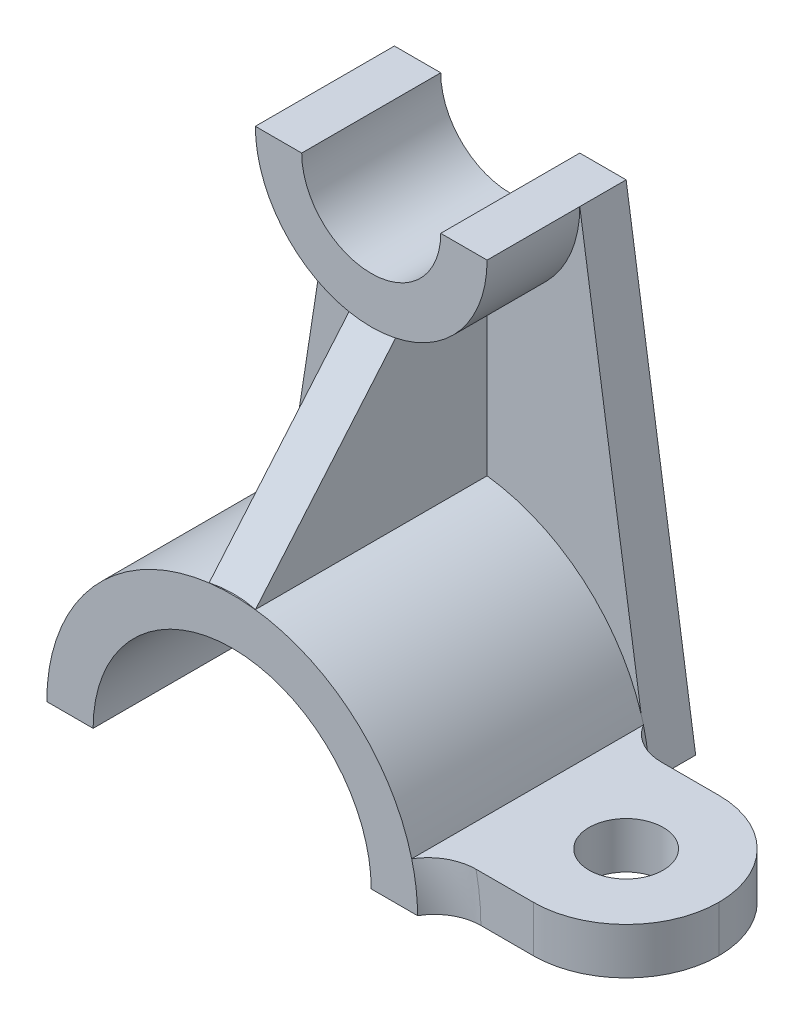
ISO-10303-21;
HEADER;
FILE_DESCRIPTION(('STEP AP214'),'2;1');
FILE_NAME('part.step','',(''),(''),'','','');
FILE_SCHEMA(('AUTOMOTIVE_DESIGN { 1 0 10303 214 1 1 1 1 }'));
ENDSEC;
DATA;
#1=APPLICATION_CONTEXT('core data for automotive mechanical design processes');
#2=APPLICATION_PROTOCOL_DEFINITION('international standard','automotive_design',2000,#1);
#3=PRODUCT_CONTEXT('',#1,'mechanical');
#4=PRODUCT('Part','Part','',(#3));
#5=PRODUCT_RELATED_PRODUCT_CATEGORY('part','',(#4));
#6=PRODUCT_DEFINITION_FORMATION('','',#4);
#7=PRODUCT_DEFINITION_CONTEXT('part definition',#1,'design');
#8=PRODUCT_DEFINITION('design','',#6,#7);
#9=PRODUCT_DEFINITION_SHAPE('','',#8);
#10=(LENGTH_UNIT() NAMED_UNIT(*) SI_UNIT(.MILLI.,.METRE.));
#11=(NAMED_UNIT(*) PLANE_ANGLE_UNIT() SI_UNIT($,.RADIAN.));
#12=(NAMED_UNIT(*) SI_UNIT($,.STERADIAN.) SOLID_ANGLE_UNIT());
#13=UNCERTAINTY_MEASURE_WITH_UNIT(LENGTH_MEASURE(1.E-05),#10,'distance_accuracy_value','');
#14=(GEOMETRIC_REPRESENTATION_CONTEXT(3) GLOBAL_UNCERTAINTY_ASSIGNED_CONTEXT((#13)) GLOBAL_UNIT_ASSIGNED_CONTEXT((#10,
#11,#12)) REPRESENTATION_CONTEXT('',''));
#15=CARTESIAN_POINT('',(0.,0.,0.));
#16=DIRECTION('',(0.,0.,1.));
#17=DIRECTION('',(1.,0.,0.));
#18=AXIS2_PLACEMENT_3D('',#15,#16,#17);
#19=CARTESIAN_POINT('',(0.,100.,0.));
#20=DIRECTION('',(0.,0.,-1.));
#21=DIRECTION('',(-1.,0.,0.));
#22=AXIS2_PLACEMENT_3D('',#19,#20,#21);
#23=PLANE('',#22);
#24=DIRECTION('',(0.,-1.,0.));
#25=VECTOR('',#24,1.);
#26=CARTESIAN_POINT('',(-5.,100.,0.));
#27=LINE('',#26,#25);
#28=CARTESIAN_POINT('',(-5.,75.5051025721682,0.));
#29=VERTEX_POINT('',#28);
#30=CARTESIAN_POINT('',(-5.,39.6862696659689,0.));
#31=VERTEX_POINT('',#30);
#32=EDGE_CURVE('E196',#29,#31,#27,.T.);
#33=ORIENTED_EDGE('',*,*,#32,.F.);
#34=CARTESIAN_POINT('',(0.,100.,0.));
#35=DIRECTION('',(0.,0.,-1.));
#36=DIRECTION('',(-1.,0.,0.));
#37=AXIS2_PLACEMENT_3D('',#34,#35,#36);
#38=CIRCLE('',#37,25.);
#39=CARTESIAN_POINT('',(-25.,100.,0.));
#40=VERTEX_POINT('',#39);
#41=EDGE_CURVE('E255',#29,#40,#38,.T.);
#42=ORIENTED_EDGE('',*,*,#41,.T.);
#43=DIRECTION('',(-0.152941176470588,-0.988235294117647,0.));
#44=VECTOR('',#43,1.);
#45=CARTESIAN_POINT('',(-40.465219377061,0.0708901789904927,0.));
#46=LINE('',#45,#44);
#47=CARTESIAN_POINT('',(-39.5294117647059,6.11764705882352,0.));
#48=VERTEX_POINT('',#47);
#49=EDGE_CURVE('E267',#40,#48,#46,.T.);
#50=ORIENTED_EDGE('',*,*,#49,.T.);
#51=CARTESIAN_POINT('',(0.,0.,0.));
#52=DIRECTION('',(0.,0.,-1.));
#53=DIRECTION('',(-1.,0.,0.));
#54=AXIS2_PLACEMENT_3D('',#51,#52,#53);
#55=CIRCLE('',#54,40.);
#56=EDGE_CURVE('E299',#48,#31,#55,.T.);
#57=ORIENTED_EDGE('',*,*,#56,.T.);
#58=EDGE_LOOP('',(#33,#42,#50,#57));
#59=FACE_BOUND('',#58,.T.);
#60=ADVANCED_FACE('F32',(#59),#23,.F.);
#61=CARTESIAN_POINT('',(0.,100.,20.));
#62=DIRECTION('',(0.,0.,-1.));
#63=DIRECTION('',(-1.,0.,0.));
#64=AXIS2_PLACEMENT_3D('',#61,#62,#63);
#65=CYLINDRICAL_SURFACE('',#64,25.);
#66=DIRECTION('',(0.,0.,-1.));
#67=VECTOR('',#66,1.);
#68=CARTESIAN_POINT('',(5.,75.5051025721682,20.));
#69=LINE('',#68,#67);
#70=CARTESIAN_POINT('',(5.,75.5051025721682,0.));
#71=VERTEX_POINT('',#70);
#72=CARTESIAN_POINT('',(5.,75.5051025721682,19.5713843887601));
#73=VERTEX_POINT('',#72);
#74=EDGE_CURVE('E201',#71,#73,#69,.F.);
#75=ORIENTED_EDGE('',*,*,#74,.F.);
#76=CARTESIAN_POINT('',(25.,100.,0.));
#77=VERTEX_POINT('',#76);
#78=EDGE_CURVE('E263',#77,#71,#38,.T.);
#79=ORIENTED_EDGE('',*,*,#78,.F.);
#80=DIRECTION('',(0.,0.,-1.));
#81=VECTOR('',#80,1.);
#82=CARTESIAN_POINT('',(25.,100.,20.));
#83=LINE('',#82,#81);
#84=CARTESIAN_POINT('',(25.,100.,20.));
#85=VERTEX_POINT('',#84);
#86=EDGE_CURVE('E252',#85,#77,#83,.T.);
#87=ORIENTED_EDGE('',*,*,#86,.F.);
#88=CARTESIAN_POINT('',(0.,100.,20.));
#89=DIRECTION('',(0.,0.,-1.));
#90=DIRECTION('',(-1.,0.,0.));
#91=AXIS2_PLACEMENT_3D('',#88,#89,#90);
#92=CIRCLE('',#91,25.);
#93=CARTESIAN_POINT('',(0.,75.,20.));
#94=VERTEX_POINT('',#93);
#95=EDGE_CURVE('E239',#85,#94,#92,.T.);
#96=ORIENTED_EDGE('',*,*,#95,.T.);
#97=CARTESIAN_POINT('',(0.,100.,-1.21428571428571));
#98=DIRECTION('',(0.,0.647015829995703,0.762476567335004));
#99=DIRECTION('',(0.,0.762476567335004,-0.647015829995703));
#100=AXIS2_PLACEMENT_3D('',#97,#98,#99);
#101=ELLIPSE('',#100,32.7878928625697,25.);
#102=EDGE_CURVE('E218',#73,#94,#101,.F.);
#103=ORIENTED_EDGE('',*,*,#102,.F.);
#104=EDGE_LOOP('',(#75,#79,#87,#96,#103));
#105=FACE_BOUND('',#104,.T.);
#106=ADVANCED_FACE('F417',(#105),#65,.T.);
#107=CARTESIAN_POINT('',(0.,0.,0.));
#108=DIRECTION('',(0.,0.,1.));
#109=DIRECTION('',(1.,0.,0.));
#110=AXIS2_PLACEMENT_3D('',#107,#108,#109);
#111=PLANE('',#110);
#112=CARTESIAN_POINT('',(0.,0.,0.));
#113=DIRECTION('',(0.,0.,1.));
#114=DIRECTION('',(1.,0.,0.));
#115=AXIS2_PLACEMENT_3D('',#112,#113,#114);
#116=CIRCLE('',#115,40.);
#117=CARTESIAN_POINT('',(-39.9999379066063,0.0704802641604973,0.));
#118=VERTEX_POINT('',#117);
#119=CARTESIAN_POINT('',(-40.,-2.61554938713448E-13,0.));
#120=VERTEX_POINT('',#119);
#121=EDGE_CURVE('E331',#118,#120,#116,.T.);
#122=ORIENTED_EDGE('',*,*,#121,.F.);
#123=DIRECTION('',(0.999999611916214,-0.000881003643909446,0.));
#124=VECTOR('',#123,1.);
#125=CARTESIAN_POINT('',(-40.465219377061,0.0708901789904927,0.));
#126=LINE('',#125,#124);
#127=CARTESIAN_POINT('',(-29.9999366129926,0.0616702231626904,0.));
#128=VERTEX_POINT('',#127);
#129=EDGE_CURVE('E275',#118,#128,#126,.T.);
#130=ORIENTED_EDGE('',*,*,#129,.T.);
#131=CARTESIAN_POINT('',(0.,0.,0.));
#132=DIRECTION('',(0.,0.,-1.));
#133=DIRECTION('',(1.,0.,0.));
#134=AXIS2_PLACEMENT_3D('',#131,#132,#133);
#135=CIRCLE('',#134,30.);
#136=CARTESIAN_POINT('',(-30.,-2.09489001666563E-13,0.));
#137=VERTEX_POINT('',#136);
#138=EDGE_CURVE('E326',#137,#128,#135,.T.);
#139=ORIENTED_EDGE('',*,*,#138,.F.);
#140=DIRECTION('',(1.,0.,0.));
#141=VECTOR('',#140,1.);
#142=CARTESIAN_POINT('',(-40.,-2.79318668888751E-13,0.));
#143=LINE('',#142,#141);
#144=EDGE_CURVE('E335',#120,#137,#143,.T.);
#145=ORIENTED_EDGE('',*,*,#144,.F.);
#146=EDGE_LOOP('',(#122,#130,#139,#145));
#147=FACE_BOUND('',#146,.T.);
#148=ADVANCED_FACE('F425',(#147),#111,.F.);
#149=CARTESIAN_POINT('',(40.,0.,0.));
#150=VERTEX_POINT('',#149);
#151=CARTESIAN_POINT('',(38.7298334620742,10.,0.));
#152=VERTEX_POINT('',#151);
#153=EDGE_CURVE('E332',#150,#152,#116,.T.);
#154=ORIENTED_EDGE('',*,*,#153,.F.);
#155=DIRECTION('',(-0.148340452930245,0.988936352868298,0.));
#156=VECTOR('',#155,1.);
#157=CARTESIAN_POINT('',(40.,0.,0.));
#158=LINE('',#157,#156);
#159=CARTESIAN_POINT('',(38.239608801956,11.7359413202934,0.));
#160=VERTEX_POINT('',#159);
#161=EDGE_CURVE('E276',#150,#160,#158,.T.);
#162=ORIENTED_EDGE('',*,*,#161,.T.);
#163=EDGE_CURVE('E336',#152,#160,#116,.T.);
#164=ORIENTED_EDGE('',*,*,#163,.F.);
#165=EDGE_LOOP('',(#154,#162,#164));
#166=FACE_BOUND('',#165,.T.);
#167=ADVANCED_FACE('F533',(#166),#111,.F.);
#168=CARTESIAN_POINT('',(0.,0.,50.));
#169=DIRECTION('',(0.,0.,-1.));
#170=DIRECTION('',(-1.,0.,0.));
#171=AXIS2_PLACEMENT_3D('',#168,#169,#170);
#172=CYLINDRICAL_SURFACE('',#171,30.);
#173=DIRECTION('',(0.,0.,-1.));
#174=VECTOR('',#173,1.);
#175=CARTESIAN_POINT('',(30.,0.,50.));
#176=LINE('',#175,#174);
#177=CARTESIAN_POINT('',(30.,0.,50.));
#178=VERTEX_POINT('',#177);
#179=CARTESIAN_POINT('',(30.,0.,0.));
#180=VERTEX_POINT('',#179);
#181=EDGE_CURVE('E355',#178,#180,#176,.T.);
#182=ORIENTED_EDGE('',*,*,#181,.F.);
#183=CARTESIAN_POINT('',(0.,0.,50.));
#184=DIRECTION('',(0.,0.,-1.));
#185=DIRECTION('',(1.,0.,0.));
#186=AXIS2_PLACEMENT_3D('',#183,#184,#185);
#187=CIRCLE('',#186,30.);
#188=CARTESIAN_POINT('',(-30.,-2.09489001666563E-13,50.));
#189=VERTEX_POINT('',#188);
#190=EDGE_CURVE('E338',#189,#178,#187,.T.);
#191=ORIENTED_EDGE('',*,*,#190,.F.);
#192=DIRECTION('',(0.,0.,-1.));
#193=VECTOR('',#192,1.);
#194=CARTESIAN_POINT('',(-30.,-2.09489001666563E-13,50.));
#195=LINE('',#194,#193);
#196=EDGE_CURVE('E349',#189,#137,#195,.T.);
#197=ORIENTED_EDGE('',*,*,#196,.T.);
#198=ORIENTED_EDGE('',*,*,#138,.T.);
#199=CARTESIAN_POINT('',(0.,0.,0.));
#200=DIRECTION('',(0.,0.,-1.));
#201=DIRECTION('',(-1.,0.,0.));
#202=AXIS2_PLACEMENT_3D('',#199,#200,#201);
#203=CIRCLE('',#202,30.);
#204=CARTESIAN_POINT('',(29.9999987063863,0.00881004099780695,0.));
#205=VERTEX_POINT('',#204);
#206=EDGE_CURVE('E302',#205,#128,#203,.F.);
#207=ORIENTED_EDGE('',*,*,#206,.F.);
#208=EDGE_CURVE('E325',#205,#180,#135,.T.);
#209=ORIENTED_EDGE('',*,*,#208,.T.);
#210=EDGE_LOOP('',(#182,#191,#197,#198,#207,#209));
#211=FACE_BOUND('',#210,.T.);
#212=ADVANCED_FACE('F34',(#211),#172,.F.);
#213=CARTESIAN_POINT('',(30.,0.,50.));
#214=DIRECTION('',(0.,1.,0.));
#215=DIRECTION('',(0.,0.,1.));
#216=AXIS2_PLACEMENT_3D('',#213,#214,#215);
#217=PLANE('',#216);
#218=CARTESIAN_POINT('',(60.,-2.61943244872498E-13,25.));
#219=DIRECTION('',(0.,1.,0.));
#220=DIRECTION('',(0.,0.,1.));
#221=AXIS2_PLACEMENT_3D('',#218,#219,#220);
#222=CIRCLE('',#221,8.);
#223=CARTESIAN_POINT('',(60.,-2.61943244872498E-13,33.));
#224=VERTEX_POINT('',#223);
#225=EDGE_CURVE('E307',#224,#224,#222,.T.);
#226=ORIENTED_EDGE('',*,*,#225,.T.);
#227=EDGE_LOOP('',(#226));
#228=FACE_BOUND('',#227,.T.);
#229=CARTESIAN_POINT('',(60.,0.,25.));
#230=DIRECTION('',(0.,1.,0.));
#231=DIRECTION('',(0.,0.,1.));
#232=AXIS2_PLACEMENT_3D('',#229,#230,#231);
#233=CIRCLE('',#232,20.);
#234=CARTESIAN_POINT('',(60.,0.,5.));
#235=VERTEX_POINT('',#234);
#236=CARTESIAN_POINT('',(80.,0.,25.));
#237=VERTEX_POINT('',#236);
#238=EDGE_CURVE('E365',#235,#237,#233,.F.);
#239=ORIENTED_EDGE('',*,*,#238,.T.);
#240=CARTESIAN_POINT('',(60.,0.,25.));
#241=DIRECTION('',(0.,1.,0.));
#242=DIRECTION('',(0.,0.,1.));
#243=AXIS2_PLACEMENT_3D('',#240,#241,#242);
#244=CIRCLE('',#243,20.);
#245=CARTESIAN_POINT('',(60.,0.,45.));
#246=VERTEX_POINT('',#245);
#247=EDGE_CURVE('E367',#237,#246,#244,.F.);
#248=ORIENTED_EDGE('',*,*,#247,.T.);
#249=DIRECTION('',(1.,0.,0.));
#250=VECTOR('',#249,1.);
#251=CARTESIAN_POINT('',(40.,0.,45.));
#252=LINE('',#251,#250);
#253=CARTESIAN_POINT('',(48.6602540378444,0.,45.));
#254=VERTEX_POINT('',#253);
#255=EDGE_CURVE('E318',#254,#246,#252,.T.);
#256=ORIENTED_EDGE('',*,*,#255,.F.);
#257=CARTESIAN_POINT('',(48.6602540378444,0.,55.));
#258=DIRECTION('',(0.,1.,0.));
#259=DIRECTION('',(0.,0.,1.));
#260=AXIS2_PLACEMENT_3D('',#257,#258,#259);
#261=CIRCLE('',#260,10.);
#262=CARTESIAN_POINT('',(40.,0.,50.));
#263=VERTEX_POINT('',#262);
#264=EDGE_CURVE('E378',#254,#263,#261,.T.);
#265=ORIENTED_EDGE('',*,*,#264,.T.);
#266=DIRECTION('',(1.,0.,0.));
#267=VECTOR('',#266,1.);
#268=CARTESIAN_POINT('',(30.,0.,50.));
#269=LINE('',#268,#267);
#270=EDGE_CURVE('E340',#178,#263,#269,.T.);
#271=ORIENTED_EDGE('',*,*,#270,.F.);
#272=ORIENTED_EDGE('',*,*,#181,.T.);
#273=DIRECTION('',(1.,0.,0.));
#274=VECTOR('',#273,1.);
#275=CARTESIAN_POINT('',(30.,0.,0.));
#276=LINE('',#275,#274);
#277=EDGE_CURVE('E329',#180,#150,#276,.T.);
#278=ORIENTED_EDGE('',*,*,#277,.T.);
#279=CARTESIAN_POINT('',(48.6602540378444,0.,-5.));
#280=DIRECTION('',(0.,1.,0.));
#281=DIRECTION('',(0.,0.,1.));
#282=AXIS2_PLACEMENT_3D('',#279,#280,#281);
#283=CIRCLE('',#282,10.);
#284=CARTESIAN_POINT('',(48.6602540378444,0.,5.));
#285=VERTEX_POINT('',#284);
#286=EDGE_CURVE('E45',#150,#285,#283,.T.);
#287=ORIENTED_EDGE('',*,*,#286,.T.);
#288=DIRECTION('',(1.,0.,0.));
#289=VECTOR('',#288,1.);
#290=CARTESIAN_POINT('',(40.,0.,5.));
#291=LINE('',#290,#289);
#292=EDGE_CURVE('E313',#285,#235,#291,.T.);
#293=ORIENTED_EDGE('',*,*,#292,.T.);
#294=EDGE_LOOP('',(#239,#248,#256,#265,#271,#272,#278,#287,#293));
#295=FACE_BOUND('',#294,.T.);
#296=ADVANCED_FACE('F560',(#228,#295),#217,.F.);
#297=CARTESIAN_POINT('',(0.,0.,50.));
#298=DIRECTION('',(0.,0.,-1.));
#299=DIRECTION('',(-1.,0.,0.));
#300=AXIS2_PLACEMENT_3D('',#297,#298,#299);
#301=CYLINDRICAL_SURFACE('',#300,40.);
#302=CARTESIAN_POINT('',(5.,39.6862696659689,0.));
#303=VERTEX_POINT('',#302);
#304=EDGE_CURVE('E290',#303,#160,#55,.T.);
#305=ORIENTED_EDGE('',*,*,#304,.F.);
#306=DIRECTION('',(0.,0.,-1.));
#307=VECTOR('',#306,1.);
#308=CARTESIAN_POINT('',(5.,39.6862696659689,50.));
#309=LINE('',#308,#307);
#310=CARTESIAN_POINT('',(5.,39.6862696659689,49.966222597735));
#311=VERTEX_POINT('',#310);
#312=EDGE_CURVE('E216',#303,#311,#309,.F.);
#313=ORIENTED_EDGE('',*,*,#312,.T.);
#314=CARTESIAN_POINT('',(0.,0.,83.6428571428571));
#315=DIRECTION('',(0.,0.647015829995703,0.762476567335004));
#316=DIRECTION('',(0.,0.762476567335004,-0.647015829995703));
#317=AXIS2_PLACEMENT_3D('',#314,#315,#316);
#318=ELLIPSE('',#317,52.4606285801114,40.);
#319=CARTESIAN_POINT('',(-5.,39.6862696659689,49.966222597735));
#320=VERTEX_POINT('',#319);
#321=EDGE_CURVE('E206',#311,#320,#318,.T.);
#322=ORIENTED_EDGE('',*,*,#321,.T.);
#323=DIRECTION('',(0.,0.,-1.));
#324=VECTOR('',#323,1.);
#325=CARTESIAN_POINT('',(-5.,39.6862696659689,50.));
#326=LINE('',#325,#324);
#327=EDGE_CURVE('E193',#31,#320,#326,.F.);
#328=ORIENTED_EDGE('',*,*,#327,.F.);
#329=ORIENTED_EDGE('',*,*,#56,.F.);
#330=EDGE_CURVE('E301',#118,#48,#55,.T.);
#331=ORIENTED_EDGE('',*,*,#330,.F.);
#332=ORIENTED_EDGE('',*,*,#121,.T.);
#333=DIRECTION('',(0.,0.,-1.));
#334=VECTOR('',#333,1.);
#335=CARTESIAN_POINT('',(-40.,-2.61554938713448E-13,50.));
#336=LINE('',#335,#334);
#337=CARTESIAN_POINT('',(-40.,-2.61554938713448E-13,50.));
#338=VERTEX_POINT('',#337);
#339=EDGE_CURVE('E352',#338,#120,#336,.T.);
#340=ORIENTED_EDGE('',*,*,#339,.F.);
#341=CARTESIAN_POINT('',(0.,0.,50.));
#342=DIRECTION('',(0.,0.,1.));
#343=DIRECTION('',(1.,0.,0.));
#344=AXIS2_PLACEMENT_3D('',#341,#342,#343);
#345=CIRCLE('',#344,40.);
#346=CARTESIAN_POINT('',(38.7298334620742,10.,50.));
#347=VERTEX_POINT('',#346);
#348=EDGE_CURVE('E343',#347,#338,#345,.T.);
#349=ORIENTED_EDGE('',*,*,#348,.F.);
#350=DIRECTION('',(0.,0.,-1.));
#351=VECTOR('',#350,1.);
#352=CARTESIAN_POINT('',(38.7298334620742,10.,45.));
#353=LINE('',#352,#351);
#354=EDGE_CURVE('E323',#347,#152,#353,.T.);
#355=ORIENTED_EDGE('',*,*,#354,.T.);
#356=ORIENTED_EDGE('',*,*,#163,.T.);
#357=EDGE_LOOP('',(#305,#313,#322,#328,#329,#331,#332,#340,#349,#355,#356));
#358=FACE_BOUND('',#357,.T.);
#359=ADVANCED_FACE('F215',(#358),#301,.T.);
#360=CARTESIAN_POINT('',(-40.,-2.79318668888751E-13,50.));
#361=DIRECTION('',(0.,1.,0.));
#362=DIRECTION('',(-1.,0.,0.));
#363=AXIS2_PLACEMENT_3D('',#360,#361,#362);
#364=PLANE('',#363);
#365=ORIENTED_EDGE('',*,*,#144,.T.);
#366=ORIENTED_EDGE('',*,*,#196,.F.);
#367=DIRECTION('',(1.,0.,0.));
#368=VECTOR('',#367,1.);
#369=CARTESIAN_POINT('',(-40.,-2.79318668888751E-13,50.));
#370=LINE('',#369,#368);
#371=EDGE_CURVE('E347',#338,#189,#370,.T.);
#372=ORIENTED_EDGE('',*,*,#371,.F.);
#373=ORIENTED_EDGE('',*,*,#339,.T.);
#374=EDGE_LOOP('',(#365,#366,#372,#373));
#375=FACE_BOUND('',#374,.T.);
#376=ADVANCED_FACE('F538',(#375),#364,.F.);
#377=CARTESIAN_POINT('',(0.,0.,50.));
#378=DIRECTION('',(0.,0.,1.));
#379=DIRECTION('',(1.,0.,0.));
#380=AXIS2_PLACEMENT_3D('',#377,#378,#379);
#381=PLANE('',#380);
#382=ORIENTED_EDGE('',*,*,#190,.T.);
#383=ORIENTED_EDGE('',*,*,#270,.T.);
#384=EDGE_CURVE('E344',#263,#347,#345,.T.);
#385=ORIENTED_EDGE('',*,*,#384,.T.);
#386=ORIENTED_EDGE('',*,*,#348,.T.);
#387=ORIENTED_EDGE('',*,*,#371,.T.);
#388=EDGE_LOOP('',(#382,#383,#385,#386,#387));
#389=FACE_BOUND('',#388,.T.);
#390=ADVANCED_FACE('F542',(#389),#381,.T.);
#391=ORIENTED_EDGE('',*,*,#208,.F.);
#392=EDGE_CURVE('E270',#205,#150,#126,.T.);
#393=ORIENTED_EDGE('',*,*,#392,.T.);
#394=ORIENTED_EDGE('',*,*,#277,.F.);
#395=EDGE_LOOP('',(#391,#393,#394));
#396=FACE_BOUND('',#395,.T.);
#397=ADVANCED_FACE('F414',(#396),#111,.F.);
#398=CARTESIAN_POINT('',(80.,10.,45.));
#399=DIRECTION('',(0.,-1.,0.));
#400=DIRECTION('',(0.,0.,-1.));
#401=AXIS2_PLACEMENT_3D('',#398,#399,#400);
#402=PLANE('',#401);
#403=CARTESIAN_POINT('',(60.,10.,25.));
#404=DIRECTION('',(0.,1.,0.));
#405=DIRECTION('',(0.,0.,1.));
#406=AXIS2_PLACEMENT_3D('',#403,#404,#405);
#407=CIRCLE('',#406,8.);
#408=CARTESIAN_POINT('',(60.,10.,33.));
#409=VERTEX_POINT('',#408);
#410=EDGE_CURVE('E304',#409,#409,#407,.T.);
#411=ORIENTED_EDGE('',*,*,#410,.F.);
#412=EDGE_LOOP('',(#411));
#413=FACE_BOUND('',#412,.T.);
#414=DIRECTION('',(-1.,0.,0.));
#415=VECTOR('',#414,1.);
#416=CARTESIAN_POINT('',(80.,10.,45.));
#417=LINE('',#416,#415);
#418=CARTESIAN_POINT('',(60.,10.,45.));
#419=VERTEX_POINT('',#418);
#420=CARTESIAN_POINT('',(47.6216371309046,10.,45.));
#421=VERTEX_POINT('',#420);
#422=EDGE_CURVE('E320',#419,#421,#417,.T.);
#423=ORIENTED_EDGE('',*,*,#422,.F.);
#424=CARTESIAN_POINT('',(60.,10.,25.));
#425=DIRECTION('',(0.,-1.,0.));
#426=DIRECTION('',(0.,0.,-1.));
#427=AXIS2_PLACEMENT_3D('',#424,#425,#426);
#428=CIRCLE('',#427,20.);
#429=CARTESIAN_POINT('',(80.,10.,25.));
#430=VERTEX_POINT('',#429);
#431=EDGE_CURVE('E363',#419,#430,#428,.F.);
#432=ORIENTED_EDGE('',*,*,#431,.T.);
#433=CARTESIAN_POINT('',(60.,10.,25.));
#434=DIRECTION('',(0.,-1.,0.));
#435=DIRECTION('',(0.,0.,-1.));
#436=AXIS2_PLACEMENT_3D('',#433,#434,#435);
#437=CIRCLE('',#436,20.);
#438=CARTESIAN_POINT('',(60.,10.,5.));
#439=VERTEX_POINT('',#438);
#440=EDGE_CURVE('E361',#430,#439,#437,.F.);
#441=ORIENTED_EDGE('',*,*,#440,.T.);
#442=DIRECTION('',(-1.,0.,0.));
#443=VECTOR('',#442,1.);
#444=CARTESIAN_POINT('',(80.,10.,5.));
#445=LINE('',#444,#443);
#446=CARTESIAN_POINT('',(47.6216371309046,10.,5.));
#447=VERTEX_POINT('',#446);
#448=EDGE_CURVE('E315',#439,#447,#445,.T.);
#449=ORIENTED_EDGE('',*,*,#448,.T.);
#450=CARTESIAN_POINT('',(47.6216371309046,10.,5.));
#451=CARTESIAN_POINT('',(47.3275635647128,10.,5.00002741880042));
#452=CARTESIAN_POINT('',(47.0334977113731,10.,4.98757710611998));
#453=CARTESIAN_POINT('',(46.4474700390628,10.,4.93797948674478));
#454=CARTESIAN_POINT('',(46.155508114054,10.,4.90083343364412));
#455=CARTESIAN_POINT('',(45.575958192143,10.,4.80213878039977));
#456=CARTESIAN_POINT('',(45.2883671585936,10.,4.74060800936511));
#457=CARTESIAN_POINT('',(44.7193773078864,10.,4.5935886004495));
#458=CARTESIAN_POINT('',(44.4379784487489,10.,4.50810012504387));
#459=CARTESIAN_POINT('',(43.883221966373,10.,4.31368918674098));
#460=CARTESIAN_POINT('',(43.6098688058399,10.,4.20475398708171));
#461=CARTESIAN_POINT('',(43.0732082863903,10.,3.96414479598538));
#462=CARTESIAN_POINT('',(42.8099055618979,10.,3.83246046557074));
#463=CARTESIAN_POINT('',(42.295507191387,10.,3.54730808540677));
#464=CARTESIAN_POINT('',(42.0444066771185,10.,3.39384882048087));
#465=CARTESIAN_POINT('',(41.5562899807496,10.,3.06619046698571));
#466=CARTESIAN_POINT('',(41.319267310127,10.,2.89200104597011));
#467=CARTESIAN_POINT('',(40.8558274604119,10.,2.51982140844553));
#468=CARTESIAN_POINT('',(40.6297696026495,10.,2.32138332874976));
#469=CARTESIAN_POINT('',(40.1960204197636,10.,1.90535802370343));
#470=CARTESIAN_POINT('',(39.9883288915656,10.,1.68777101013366));
#471=CARTESIAN_POINT('',(39.5925441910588,10.,1.23435889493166));
#472=CARTESIAN_POINT('',(39.4045075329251,10.,0.998484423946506));
#473=CARTESIAN_POINT('',(39.0503222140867,10.,0.510765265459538));
#474=CARTESIAN_POINT('',(38.8841782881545,10.,0.258917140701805));
#475=CARTESIAN_POINT('',(38.7298334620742,10.,0.));
#476=B_SPLINE_CURVE_WITH_KNOTS('',3,(#450,#451,#452,#453,#454,#455,#456,#457,#458,#459,#460,
#461,#462,#463,#464,#465,#466,#467,#468,#469,#470,#471,#472,#473,#474,#475),.UNSPECIFIED.,.F.,
.F.,(4,2,2,2,2,2,2,2,2,2,2,2,4),(0.,0.881946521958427,1.76384827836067,2.64510641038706,
3.52635856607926,4.40809065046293,5.2902245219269,6.17200351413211,7.05337288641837,
7.95460227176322,8.8558216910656,9.75956497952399,10.6635034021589),.UNSPECIFIED.);
#477=EDGE_CURVE('E11',#447,#152,#476,.T.);
#478=ORIENTED_EDGE('',*,*,#477,.T.);
#479=ORIENTED_EDGE('',*,*,#354,.F.);
#480=CARTESIAN_POINT('',(38.7298334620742,10.,50.));
#481=CARTESIAN_POINT('',(38.8768130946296,10.,49.7534474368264));
#482=CARTESIAN_POINT('',(39.0344881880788,10.,49.5132998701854));
#483=CARTESIAN_POINT('',(39.3697661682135,10.,49.0474146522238));
#484=CARTESIAN_POINT('',(39.5473649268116,10.,48.821674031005));
#485=CARTESIAN_POINT('',(39.9206019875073,10.,48.3866670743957));
#486=CARTESIAN_POINT('',(40.1161920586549,10.,48.1773593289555));
#487=CARTESIAN_POINT('',(40.5242729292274,10.,47.7759168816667));
#488=CARTESIAN_POINT('',(40.7367642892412,10.,47.5837827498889));
#489=CARTESIAN_POINT('',(41.1769775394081,10.,47.2179742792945));
#490=CARTESIAN_POINT('',(41.4046951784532,10.,47.0442948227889));
#491=CARTESIAN_POINT('',(41.8738510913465,10.,46.7163510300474));
#492=CARTESIAN_POINT('',(42.1152953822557,10.,46.5620953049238));
#493=CARTESIAN_POINT('',(42.6102602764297,10.,46.2739519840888));
#494=CARTESIAN_POINT('',(42.8637887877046,10.,46.1400779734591));
#495=CARTESIAN_POINT('',(43.380892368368,10.,45.8937049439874));
#496=CARTESIAN_POINT('',(43.6444633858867,10.,45.7811974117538));
#497=CARTESIAN_POINT('',(44.2074399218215,10.,45.5677750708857));
#498=CARTESIAN_POINT('',(44.507748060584,10.,45.4692329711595));
#499=CARTESIAN_POINT('',(45.1160624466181,10.,45.2996699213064));
#500=CARTESIAN_POINT('',(45.4240695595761,10.,45.2286520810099));
#501=CARTESIAN_POINT('',(46.04570212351,10.,45.1146504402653));
#502=CARTESIAN_POINT('',(46.3593351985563,10.,45.0717081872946));
#503=CARTESIAN_POINT('',(46.9891881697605,10.,45.0143649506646));
#504=CARTESIAN_POINT('',(47.3054079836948,10.,44.9999630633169));
#505=CARTESIAN_POINT('',(47.6216371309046,10.,45.));
#506=B_SPLINE_CURVE_WITH_KNOTS('',3,(#480,#481,#482,#483,#484,#485,#486,#487,#488,#489,#490,
#491,#492,#493,#494,#495,#496,#497,#498,#499,#500,#501,#502,#503,#504,#505),.UNSPECIFIED.,.F.,
.F.,(4,2,2,2,2,2,2,2,2,2,2,2,4),(0.,0.860812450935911,1.72144687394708,2.5798378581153,
3.43825732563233,4.29643811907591,5.15499803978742,6.01412773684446,6.87291439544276,
7.81978670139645,8.76676595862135,9.71514344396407,10.663490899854),.UNSPECIFIED.);
#507=EDGE_CURVE('E380',#347,#421,#506,.T.);
#508=ORIENTED_EDGE('',*,*,#507,.T.);
#509=EDGE_LOOP('',(#423,#432,#441,#449,#478,#479,#508));
#510=FACE_BOUND('',#509,.T.);
#511=ADVANCED_FACE('F385',(#413,#510),#402,.F.);
#512=CARTESIAN_POINT('',(0.,0.,45.));
#513=DIRECTION('',(0.,0.,1.));
#514=DIRECTION('',(1.,0.,0.));
#515=AXIS2_PLACEMENT_3D('',#512,#513,#514);
#516=PLANE('',#515);
#517=ORIENTED_EDGE('',*,*,#422,.T.);
#518=CARTESIAN_POINT('',(0.,0.,45.));
#519=DIRECTION('',(0.,0.,1.));
#520=DIRECTION('',(1.,0.,0.));
#521=AXIS2_PLACEMENT_3D('',#518,#519,#520);
#522=CIRCLE('',#521,48.6602540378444);
#523=EDGE_CURVE('E373',#421,#254,#522,.F.);
#524=ORIENTED_EDGE('',*,*,#523,.T.);
#525=ORIENTED_EDGE('',*,*,#255,.T.);
#526=DIRECTION('',(0.,1.,0.));
#527=VECTOR('',#526,1.);
#528=CARTESIAN_POINT('',(60.,10.,45.));
#529=LINE('',#528,#527);
#530=EDGE_CURVE('E358',#246,#419,#529,.T.);
#531=ORIENTED_EDGE('',*,*,#530,.T.);
#532=EDGE_LOOP('',(#517,#524,#525,#531));
#533=FACE_BOUND('',#532,.T.);
#534=ADVANCED_FACE('F407',(#533),#516,.T.);
#535=CARTESIAN_POINT('',(0.,0.,5.));
#536=DIRECTION('',(0.,0.,1.));
#537=DIRECTION('',(1.,0.,0.));
#538=AXIS2_PLACEMENT_3D('',#535,#536,#537);
#539=PLANE('',#538);
#540=ORIENTED_EDGE('',*,*,#292,.F.);
#541=CARTESIAN_POINT('',(0.,0.,5.));
#542=DIRECTION('',(0.,0.,1.));
#543=DIRECTION('',(1.,0.,0.));
#544=AXIS2_PLACEMENT_3D('',#541,#542,#543);
#545=CIRCLE('',#544,48.6602540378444);
#546=EDGE_CURVE('E376',#285,#447,#545,.T.);
#547=ORIENTED_EDGE('',*,*,#546,.T.);
#548=ORIENTED_EDGE('',*,*,#448,.F.);
#549=DIRECTION('',(0.,1.,0.));
#550=VECTOR('',#549,1.);
#551=CARTESIAN_POINT('',(60.,0.,5.));
#552=LINE('',#551,#550);
#553=EDGE_CURVE('E370',#439,#235,#552,.F.);
#554=ORIENTED_EDGE('',*,*,#553,.T.);
#555=EDGE_LOOP('',(#540,#547,#548,#554));
#556=FACE_BOUND('',#555,.T.);
#557=ADVANCED_FACE('F404',(#556),#539,.F.);
#558=CARTESIAN_POINT('',(60.,0.,25.));
#559=DIRECTION('',(0.,1.,0.));
#560=DIRECTION('',(0.,0.,1.));
#561=AXIS2_PLACEMENT_3D('',#558,#559,#560);
#562=CYLINDRICAL_SURFACE('',#561,20.);
#563=DIRECTION('',(0.,1.,0.));
#564=VECTOR('',#563,1.);
#565=CARTESIAN_POINT('',(80.,0.,25.));
#566=LINE('',#565,#564);
#567=EDGE_CURVE('E310',#237,#430,#566,.T.);
#568=ORIENTED_EDGE('',*,*,#567,.F.);
#569=ORIENTED_EDGE('',*,*,#238,.F.);
#570=ORIENTED_EDGE('',*,*,#553,.F.);
#571=ORIENTED_EDGE('',*,*,#440,.F.);
#572=EDGE_LOOP('',(#568,#569,#570,#571));
#573=FACE_BOUND('',#572,.T.);
#574=ADVANCED_FACE('F400',(#573),#562,.T.);
#575=CARTESIAN_POINT('',(60.,0.,25.));
#576=DIRECTION('',(0.,-1.,0.));
#577=DIRECTION('',(0.,0.,-1.));
#578=AXIS2_PLACEMENT_3D('',#575,#576,#577);
#579=CYLINDRICAL_SURFACE('',#578,20.);
#580=ORIENTED_EDGE('',*,*,#247,.F.);
#581=ORIENTED_EDGE('',*,*,#567,.T.);
#582=ORIENTED_EDGE('',*,*,#431,.F.);
#583=ORIENTED_EDGE('',*,*,#530,.F.);
#584=EDGE_LOOP('',(#580,#581,#582,#583));
#585=FACE_BOUND('',#584,.T.);
#586=ADVANCED_FACE('F394',(#585),#579,.T.);
#587=CARTESIAN_POINT('',(0.,0.,55.));
#588=DIRECTION('',(0.,0.,1.));
#589=DIRECTION('',(1.,0.,0.));
#590=AXIS2_PLACEMENT_3D('',#587,#588,#589);
#591=TOROIDAL_SURFACE('',#590,48.6602540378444,10.);
#592=ORIENTED_EDGE('',*,*,#507,.F.);
#593=ORIENTED_EDGE('',*,*,#384,.F.);
#594=ORIENTED_EDGE('',*,*,#264,.F.);
#595=ORIENTED_EDGE('',*,*,#523,.F.);
#596=EDGE_LOOP('',(#592,#593,#594,#595));
#597=FACE_BOUND('',#596,.T.);
#598=ADVANCED_FACE('F389',(#597),#591,.F.);
#599=CARTESIAN_POINT('',(0.,0.,-5.));
#600=DIRECTION('',(0.,0.,1.));
#601=DIRECTION('',(1.,0.,0.));
#602=AXIS2_PLACEMENT_3D('',#599,#600,#601);
#603=TOROIDAL_SURFACE('',#602,48.6602540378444,10.);
#604=ORIENTED_EDGE('',*,*,#477,.F.);
#605=ORIENTED_EDGE('',*,*,#546,.F.);
#606=ORIENTED_EDGE('',*,*,#286,.F.);
#607=ORIENTED_EDGE('',*,*,#153,.T.);
#608=EDGE_LOOP('',(#604,#605,#606,#607));
#609=FACE_BOUND('',#608,.T.);
#610=ADVANCED_FACE('F393',(#609),#603,.F.);
#611=CARTESIAN_POINT('',(60.,-2.61943244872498E-13,25.));
#612=DIRECTION('',(0.,1.,0.));
#613=DIRECTION('',(0.,0.,1.));
#614=AXIS2_PLACEMENT_3D('',#611,#612,#613);
#615=CYLINDRICAL_SURFACE('',#614,8.);
#616=ORIENTED_EDGE('',*,*,#225,.F.);
#617=EDGE_LOOP('',(#616));
#618=FACE_BOUND('',#617,.T.);
#619=ORIENTED_EDGE('',*,*,#410,.T.);
#620=EDGE_LOOP('',(#619));
#621=FACE_BOUND('',#620,.T.);
#622=ADVANCED_FACE('F434',(#618,#621),#615,.F.);
#623=ORIENTED_EDGE('',*,*,#206,.T.);
#624=EDGE_CURVE('E511',#128,#205,#126,.T.);
#625=ORIENTED_EDGE('',*,*,#624,.T.);
#626=EDGE_LOOP('',(#623,#625));
#627=FACE_BOUND('',#626,.T.);
#628=ADVANCED_FACE('F421',(#627),#23,.F.);
#629=CARTESIAN_POINT('',(-40.465219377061,0.0708901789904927,0.));
#630=VERTEX_POINT('',#629);
#631=EDGE_CURVE('E271',#630,#118,#126,.T.);
#632=ORIENTED_EDGE('',*,*,#631,.T.);
#633=ORIENTED_EDGE('',*,*,#330,.T.);
#634=EDGE_CURVE('E266',#48,#630,#46,.T.);
#635=ORIENTED_EDGE('',*,*,#634,.T.);
#636=EDGE_LOOP('',(#632,#633,#635));
#637=FACE_BOUND('',#636,.T.);
#638=ADVANCED_FACE('F420',(#637),#23,.F.);
#639=ORIENTED_EDGE('',*,*,#78,.T.);
#640=DIRECTION('',(0.,-1.,0.));
#641=VECTOR('',#640,1.);
#642=CARTESIAN_POINT('',(5.,100.,0.));
#643=LINE('',#642,#641);
#644=EDGE_CURVE('E226',#71,#303,#643,.T.);
#645=ORIENTED_EDGE('',*,*,#644,.T.);
#646=ORIENTED_EDGE('',*,*,#304,.T.);
#647=EDGE_CURVE('E274',#160,#77,#158,.T.);
#648=ORIENTED_EDGE('',*,*,#647,.T.);
#649=EDGE_LOOP('',(#639,#645,#646,#648));
#650=FACE_BOUND('',#649,.T.);
#651=ADVANCED_FACE('F431',(#650),#23,.F.);
#652=CARTESIAN_POINT('',(40.,0.,-10.));
#653=DIRECTION('',(0.988936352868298,0.148340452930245,0.));
#654=DIRECTION('',(-0.148340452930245,0.988936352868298,0.));
#655=AXIS2_PLACEMENT_3D('',#652,#653,#654);
#656=PLANE('',#655);
#657=ORIENTED_EDGE('',*,*,#161,.F.);
#658=DIRECTION('',(0.,0.,1.));
#659=VECTOR('',#658,1.);
#660=CARTESIAN_POINT('',(40.,0.,-10.));
#661=LINE('',#660,#659);
#662=CARTESIAN_POINT('',(40.,0.,-10.));
#663=VERTEX_POINT('',#662);
#664=EDGE_CURVE('E291',#663,#150,#661,.T.);
#665=ORIENTED_EDGE('',*,*,#664,.F.);
#666=DIRECTION('',(-0.148340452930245,0.988936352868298,0.));
#667=VECTOR('',#666,1.);
#668=CARTESIAN_POINT('',(40.,0.,-10.));
#669=LINE('',#668,#667);
#670=CARTESIAN_POINT('',(25.,100.,-10.));
#671=VERTEX_POINT('',#670);
#672=EDGE_CURVE('E284',#663,#671,#669,.T.);
#673=ORIENTED_EDGE('',*,*,#672,.T.);
#674=DIRECTION('',(0.,0.,1.));
#675=VECTOR('',#674,1.);
#676=CARTESIAN_POINT('',(25.,100.,-10.));
#677=LINE('',#676,#675);
#678=EDGE_CURVE('E287',#671,#77,#677,.T.);
#679=ORIENTED_EDGE('',*,*,#678,.T.);
#680=ORIENTED_EDGE('',*,*,#647,.F.);
#681=EDGE_LOOP('',(#657,#665,#673,#679,#680));
#682=FACE_BOUND('',#681,.T.);
#683=ADVANCED_FACE('F441',(#682),#656,.T.);
#684=CARTESIAN_POINT('',(-40.465219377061,0.0708901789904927,-10.));
#685=DIRECTION('',(-0.000881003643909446,-0.999999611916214,0.));
#686=DIRECTION('',(0.999999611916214,-0.000881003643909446,0.));
#687=AXIS2_PLACEMENT_3D('',#684,#685,#686);
#688=PLANE('',#687);
#689=ORIENTED_EDGE('',*,*,#392,.F.);
#690=ORIENTED_EDGE('',*,*,#624,.F.);
#691=ORIENTED_EDGE('',*,*,#129,.F.);
#692=ORIENTED_EDGE('',*,*,#631,.F.);
#693=DIRECTION('',(0.,0.,1.));
#694=VECTOR('',#693,1.);
#695=CARTESIAN_POINT('',(-40.465219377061,0.0708901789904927,-10.));
#696=LINE('',#695,#694);
#697=CARTESIAN_POINT('',(-40.465219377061,0.0708901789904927,-10.));
#698=VERTEX_POINT('',#697);
#699=EDGE_CURVE('E294',#698,#630,#696,.T.);
#700=ORIENTED_EDGE('',*,*,#699,.F.);
#701=DIRECTION('',(0.999999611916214,-0.000881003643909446,0.));
#702=VECTOR('',#701,1.);
#703=CARTESIAN_POINT('',(-40.465219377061,0.0708901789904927,-10.));
#704=LINE('',#703,#702);
#705=EDGE_CURVE('E282',#698,#663,#704,.T.);
#706=ORIENTED_EDGE('',*,*,#705,.T.);
#707=ORIENTED_EDGE('',*,*,#664,.T.);
#708=EDGE_LOOP('',(#689,#690,#691,#692,#700,#706,#707));
#709=FACE_BOUND('',#708,.T.);
#710=ADVANCED_FACE('F446',(#709),#688,.T.);
#711=CARTESIAN_POINT('',(-40.465219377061,0.0708901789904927,-10.));
#712=DIRECTION('',(-0.988235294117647,0.152941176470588,0.));
#713=DIRECTION('',(-0.152941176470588,-0.988235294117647,0.));
#714=AXIS2_PLACEMENT_3D('',#711,#712,#713);
#715=PLANE('',#714);
#716=ORIENTED_EDGE('',*,*,#49,.F.);
#717=DIRECTION('',(0.,0.,1.));
#718=VECTOR('',#717,1.);
#719=CARTESIAN_POINT('',(-25.,100.,-10.));
#720=LINE('',#719,#718);
#721=CARTESIAN_POINT('',(-25.,100.,-10.));
#722=VERTEX_POINT('',#721);
#723=EDGE_CURVE('E286',#722,#40,#720,.T.);
#724=ORIENTED_EDGE('',*,*,#723,.F.);
#725=DIRECTION('',(-0.152941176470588,-0.988235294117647,0.));
#726=VECTOR('',#725,1.);
#727=CARTESIAN_POINT('',(-40.465219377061,0.0708901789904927,-10.));
#728=LINE('',#727,#726);
#729=EDGE_CURVE('E279',#722,#698,#728,.T.);
#730=ORIENTED_EDGE('',*,*,#729,.T.);
#731=ORIENTED_EDGE('',*,*,#699,.T.);
#732=ORIENTED_EDGE('',*,*,#634,.F.);
#733=EDGE_LOOP('',(#716,#724,#730,#731,#732));
#734=FACE_BOUND('',#733,.T.);
#735=ADVANCED_FACE('F494',(#734),#715,.T.);
#736=CARTESIAN_POINT('',(0.,100.,-10.));
#737=DIRECTION('',(0.,0.,-1.));
#738=DIRECTION('',(-1.,0.,0.));
#739=AXIS2_PLACEMENT_3D('',#736,#737,#738);
#740=PLANE('',#739);
#741=ORIENTED_EDGE('',*,*,#672,.F.);
#742=ORIENTED_EDGE('',*,*,#705,.F.);
#743=ORIENTED_EDGE('',*,*,#729,.F.);
#744=DIRECTION('',(1.,0.,0.));
#745=VECTOR('',#744,1.);
#746=CARTESIAN_POINT('',(-15.,100.,-10.));
#747=LINE('',#746,#745);
#748=CARTESIAN_POINT('',(-15.,100.,-10.));
#749=VERTEX_POINT('',#748);
#750=EDGE_CURVE('E230',#722,#749,#747,.T.);
#751=ORIENTED_EDGE('',*,*,#750,.T.);
#752=CARTESIAN_POINT('',(0.,100.,-10.));
#753=DIRECTION('',(0.,0.,1.));
#754=DIRECTION('',(1.,0.,0.));
#755=AXIS2_PLACEMENT_3D('',#752,#753,#754);
#756=CIRCLE('',#755,15.);
#757=CARTESIAN_POINT('',(15.,100.,-10.));
#758=VERTEX_POINT('',#757);
#759=EDGE_CURVE('E233',#749,#758,#756,.T.);
#760=ORIENTED_EDGE('',*,*,#759,.T.);
#761=DIRECTION('',(1.,0.,0.));
#762=VECTOR('',#761,1.);
#763=CARTESIAN_POINT('',(15.,100.,-10.));
#764=LINE('',#763,#762);
#765=EDGE_CURVE('E235',#758,#671,#764,.T.);
#766=ORIENTED_EDGE('',*,*,#765,.T.);
#767=EDGE_LOOP('',(#741,#742,#743,#751,#760,#766));
#768=FACE_BOUND('',#767,.T.);
#769=ADVANCED_FACE('F490',(#768),#740,.T.);
#770=CARTESIAN_POINT('',(-5.,75.5051025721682,19.5713843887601));
#771=VERTEX_POINT('',#770);
#772=EDGE_CURVE('E209',#94,#771,#101,.F.);
#773=ORIENTED_EDGE('',*,*,#772,.F.);
#774=CARTESIAN_POINT('',(-25.,100.,20.));
#775=VERTEX_POINT('',#774);
#776=EDGE_CURVE('E238',#94,#775,#92,.T.);
#777=ORIENTED_EDGE('',*,*,#776,.T.);
#778=DIRECTION('',(0.,0.,-1.));
#779=VECTOR('',#778,1.);
#780=CARTESIAN_POINT('',(-25.,100.,20.));
#781=LINE('',#780,#779);
#782=EDGE_CURVE('E251',#775,#40,#781,.T.);
#783=ORIENTED_EDGE('',*,*,#782,.T.);
#784=ORIENTED_EDGE('',*,*,#41,.F.);
#785=DIRECTION('',(0.,0.,-1.));
#786=VECTOR('',#785,1.);
#787=CARTESIAN_POINT('',(-5.,75.5051025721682,20.));
#788=LINE('',#787,#786);
#789=EDGE_CURVE('E217',#29,#771,#788,.F.);
#790=ORIENTED_EDGE('',*,*,#789,.T.);
#791=EDGE_LOOP('',(#773,#777,#783,#784,#790));
#792=FACE_BOUND('',#791,.T.);
#793=ADVANCED_FACE('F428',(#792),#65,.T.);
#794=CARTESIAN_POINT('',(15.,100.,20.));
#795=DIRECTION('',(0.,1.,0.));
#796=DIRECTION('',(-1.,0.,0.));
#797=AXIS2_PLACEMENT_3D('',#794,#795,#796);
#798=PLANE('',#797);
#799=ORIENTED_EDGE('',*,*,#765,.F.);
#800=DIRECTION('',(0.,0.,-1.));
#801=VECTOR('',#800,1.);
#802=CARTESIAN_POINT('',(15.,100.,20.));
#803=LINE('',#802,#801);
#804=CARTESIAN_POINT('',(15.,100.,20.));
#805=VERTEX_POINT('',#804);
#806=EDGE_CURVE('E256',#805,#758,#803,.T.);
#807=ORIENTED_EDGE('',*,*,#806,.F.);
#808=DIRECTION('',(1.,0.,0.));
#809=VECTOR('',#808,1.);
#810=CARTESIAN_POINT('',(15.,100.,20.));
#811=LINE('',#810,#809);
#812=EDGE_CURVE('E248',#805,#85,#811,.T.);
#813=ORIENTED_EDGE('',*,*,#812,.T.);
#814=ORIENTED_EDGE('',*,*,#86,.T.);
#815=ORIENTED_EDGE('',*,*,#678,.F.);
#816=EDGE_LOOP('',(#799,#807,#813,#814,#815));
#817=FACE_BOUND('',#816,.T.);
#818=ADVANCED_FACE('F457',(#817),#798,.T.);
#819=CARTESIAN_POINT('',(0.,100.,20.));
#820=DIRECTION('',(0.,0.,-1.));
#821=DIRECTION('',(-1.,0.,0.));
#822=AXIS2_PLACEMENT_3D('',#819,#820,#821);
#823=CYLINDRICAL_SURFACE('',#822,15.);
#824=ORIENTED_EDGE('',*,*,#806,.T.);
#825=ORIENTED_EDGE('',*,*,#759,.F.);
#826=DIRECTION('',(0.,0.,-1.));
#827=VECTOR('',#826,1.);
#828=CARTESIAN_POINT('',(-15.,100.,20.));
#829=LINE('',#828,#827);
#830=CARTESIAN_POINT('',(-15.,100.,20.));
#831=VERTEX_POINT('',#830);
#832=EDGE_CURVE('E259',#831,#749,#829,.T.);
#833=ORIENTED_EDGE('',*,*,#832,.F.);
#834=CARTESIAN_POINT('',(0.,100.,20.));
#835=DIRECTION('',(0.,0.,1.));
#836=DIRECTION('',(1.,0.,0.));
#837=AXIS2_PLACEMENT_3D('',#834,#835,#836);
#838=CIRCLE('',#837,15.);
#839=EDGE_CURVE('E245',#831,#805,#838,.T.);
#840=ORIENTED_EDGE('',*,*,#839,.T.);
#841=EDGE_LOOP('',(#824,#825,#833,#840));
#842=FACE_BOUND('',#841,.T.);
#843=ADVANCED_FACE('F483',(#842),#823,.F.);
#844=CARTESIAN_POINT('',(-15.,100.,20.));
#845=DIRECTION('',(0.,1.,0.));
#846=DIRECTION('',(0.,0.,1.));
#847=AXIS2_PLACEMENT_3D('',#844,#845,#846);
#848=PLANE('',#847);
#849=ORIENTED_EDGE('',*,*,#750,.F.);
#850=ORIENTED_EDGE('',*,*,#723,.T.);
#851=ORIENTED_EDGE('',*,*,#782,.F.);
#852=DIRECTION('',(1.,0.,0.));
#853=VECTOR('',#852,1.);
#854=CARTESIAN_POINT('',(-15.,100.,20.));
#855=LINE('',#854,#853);
#856=EDGE_CURVE('E242',#775,#831,#855,.T.);
#857=ORIENTED_EDGE('',*,*,#856,.T.);
#858=ORIENTED_EDGE('',*,*,#832,.T.);
#859=EDGE_LOOP('',(#849,#850,#851,#857,#858));
#860=FACE_BOUND('',#859,.T.);
#861=ADVANCED_FACE('F476',(#860),#848,.T.);
#862=CARTESIAN_POINT('',(0.,100.,20.));
#863=DIRECTION('',(0.,0.,-1.));
#864=DIRECTION('',(-1.,0.,0.));
#865=AXIS2_PLACEMENT_3D('',#862,#863,#864);
#866=PLANE('',#865);
#867=ORIENTED_EDGE('',*,*,#95,.F.);
#868=ORIENTED_EDGE('',*,*,#812,.F.);
#869=ORIENTED_EDGE('',*,*,#839,.F.);
#870=ORIENTED_EDGE('',*,*,#856,.F.);
#871=ORIENTED_EDGE('',*,*,#776,.F.);
#872=EDGE_LOOP('',(#867,#868,#869,#870,#871));
#873=FACE_BOUND('',#872,.T.);
#874=ADVANCED_FACE('F461',(#873),#866,.F.);
#875=CARTESIAN_POINT('',(5.,50.,20.3398459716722));
#876=DIRECTION('',(1.,0.,0.));
#877=DIRECTION('',(0.,0.,-1.));
#878=AXIS2_PLACEMENT_3D('',#875,#876,#877);
#879=PLANE('',#878);
#880=ORIENTED_EDGE('',*,*,#312,.F.);
#881=ORIENTED_EDGE('',*,*,#644,.F.);
#882=ORIENTED_EDGE('',*,*,#74,.T.);
#883=DIRECTION('',(0.,-0.762476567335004,0.647015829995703));
#884=VECTOR('',#883,1.);
#885=CARTESIAN_POINT('',(5.,75.,20.));
#886=LINE('',#885,#884);
#887=EDGE_CURVE('E211',#73,#311,#886,.T.);
#888=ORIENTED_EDGE('',*,*,#887,.T.);
#889=EDGE_LOOP('',(#880,#881,#882,#888));
#890=FACE_BOUND('',#889,.T.);
#891=ADVANCED_FACE('F468',(#890),#879,.T.);
#892=CARTESIAN_POINT('',(-5.,50.,20.3398459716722));
#893=DIRECTION('',(1.,0.,0.));
#894=DIRECTION('',(0.,0.,-1.));
#895=AXIS2_PLACEMENT_3D('',#892,#893,#894);
#896=PLANE('',#895);
#897=ORIENTED_EDGE('',*,*,#32,.T.);
#898=ORIENTED_EDGE('',*,*,#327,.T.);
#899=DIRECTION('',(0.,-0.762476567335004,0.647015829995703));
#900=VECTOR('',#899,1.);
#901=CARTESIAN_POINT('',(-5.,75.,20.));
#902=LINE('',#901,#900);
#903=EDGE_CURVE('E52',#771,#320,#902,.T.);
#904=ORIENTED_EDGE('',*,*,#903,.F.);
#905=ORIENTED_EDGE('',*,*,#789,.F.);
#906=EDGE_LOOP('',(#897,#898,#904,#905));
#907=FACE_BOUND('',#906,.T.);
#908=ADVANCED_FACE('F194',(#907),#896,.F.);
#909=CARTESIAN_POINT('',(0.,75.,20.));
#910=DIRECTION('',(0.,0.647015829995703,0.762476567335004));
#911=DIRECTION('',(0.,-0.762476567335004,0.647015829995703));
#912=AXIS2_PLACEMENT_3D('',#909,#910,#911);
#913=PLANE('',#912);
#914=ORIENTED_EDGE('',*,*,#321,.F.);
#915=ORIENTED_EDGE('',*,*,#887,.F.);
#916=ORIENTED_EDGE('',*,*,#102,.T.);
#917=ORIENTED_EDGE('',*,*,#772,.T.);
#918=ORIENTED_EDGE('',*,*,#903,.T.);
#919=EDGE_LOOP('',(#914,#915,#916,#917,#918));
#920=FACE_BOUND('',#919,.T.);
#921=ADVANCED_FACE('F204',(#920),#913,.T.);
#922=CLOSED_SHELL('',(#60,#106,#148,#167,#212,#296,#359,#376,#390,#397,#511,#534,#557,#574,#586,
#598,#610,#622,#628,#638,#651,#683,#710,#735,#769,#793,#818,#843,#861,#874,#891,#908,#921));
#923=MANIFOLD_SOLID_BREP('B2',#922);
#924=ADVANCED_BREP_SHAPE_REPRESENTATION('',(#18,#923),#14);
#925=SHAPE_DEFINITION_REPRESENTATION(#9,#924);
ENDSEC;
END-ISO-10303-21;
